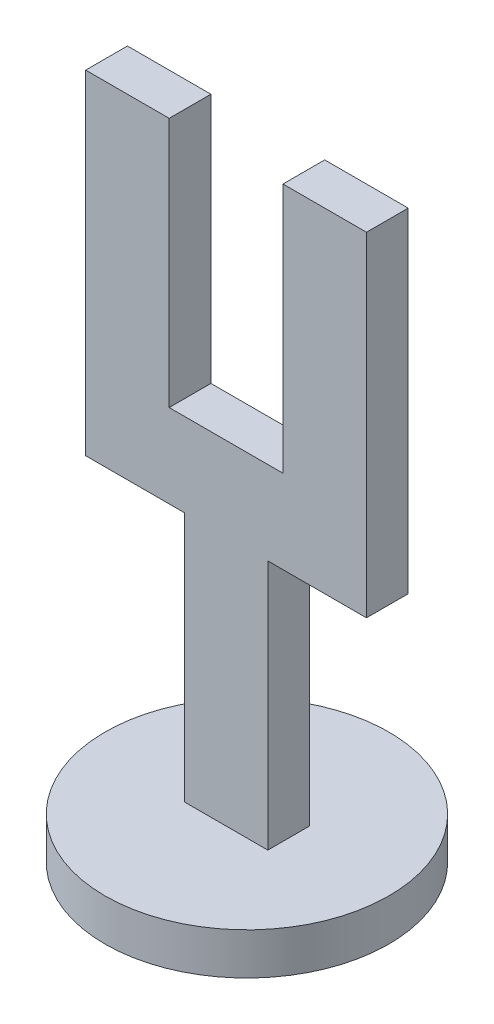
from build123d import *

# Parameters (mm, degrees)
SKETCH1_R           = 17
BOSS_EXTRUDE1_DEPTH = 5
SKETCH2_R           = 15.5
CUT_EXTRUDE1_DEPTH  = 2.5
SKETCH3_W           = 10
SKETCH3_H           = 5
BOSS_EXTRUDE2_DEPTH = 30
SKETCH4_W           = 33.630343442
SKETCH4_H           = 5
BOSS_EXTRUDE3_DEPTH = 10
SKETCH5_W           = 10
SKETCH5_H           = 5
BOSS_EXTRUDE4_DEPTH = 30


with BuildPart() as part:
    # Sketch1 → Boss-Extrude1 (new body)
    with BuildSketch(Plane(origin=(0, 0, 0), x_dir=(1, 0, 0), z_dir=(0, 1, 0))):
        with Locations(Location((0, 0, 0), (0, 0, 270))):
            Circle(SKETCH1_R)
    extrude(amount=BOSS_EXTRUDE1_DEPTH)

    # Sketch2 → Cut-Extrude1 (cut)
    with BuildSketch(Plane.XZ):
        with Locations(Location((0, 0, 0), (0, 0, 270))):
            Circle(SKETCH2_R)
    extrude(amount=-CUT_EXTRUDE1_DEPTH, mode=Mode.SUBTRACT)

    # Sketch3 → Boss-Extrude2 (add)
    with BuildSketch(Plane(origin=(0, 5, 0), x_dir=(1, 0, 0), z_dir=(0, 1, 0))):
        Rectangle(SKETCH3_W, SKETCH3_H)
    extrude(amount=BOSS_EXTRUDE2_DEPTH)

    # Sketch4 → Boss-Extrude3 (add)
    with BuildSketch(Plane(origin=(0, 35, 0), x_dir=(1, 0, 0), z_dir=(0, 1, 0))):
        Rectangle(SKETCH4_W, SKETCH4_H)
    extrude(amount=BOSS_EXTRUDE3_DEPTH)

    # Sketch5 → Boss-Extrude4 (add)
    with BuildSketch(Plane(origin=(0, 45, 0), x_dir=(1, 0, 0), z_dir=(0, 1, 0))):
        with Locations((11.815171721, 0)):
            Rectangle(SKETCH5_W, SKETCH5_H)
        with Locations((-11.815171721, 0)):
            Rectangle(SKETCH5_W, SKETCH5_H)
    extrude(amount=BOSS_EXTRUDE4_DEPTH)


solid = part.part
